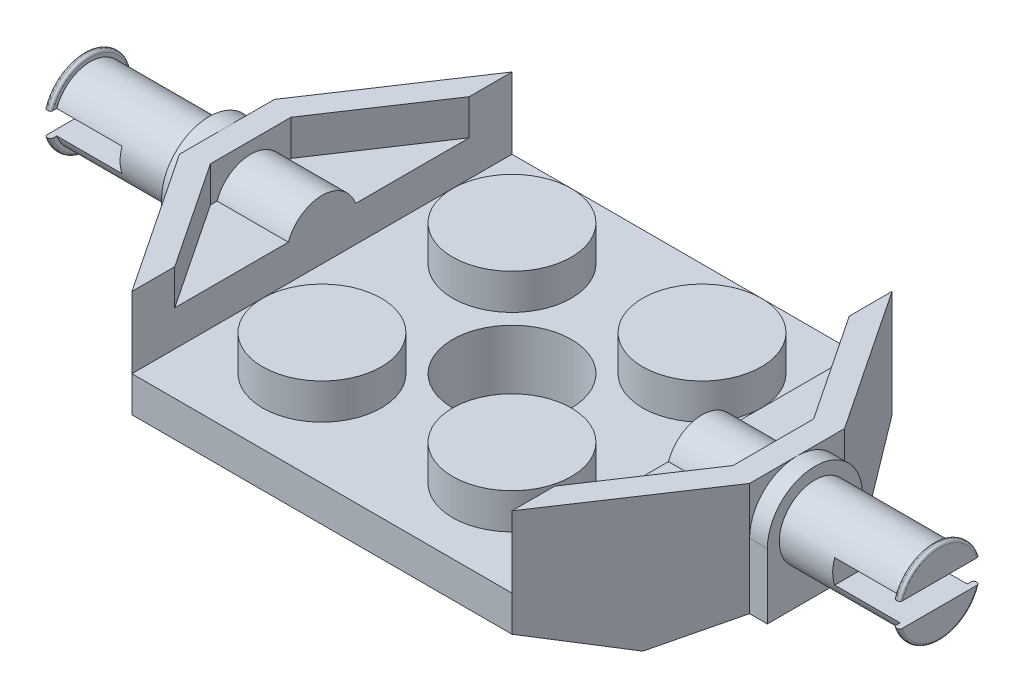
from build123d import *

# Parameters (mm, degrees)
ESQUISSE1_W                  = 16
ESQUISSE1_H                  = 16
EXTRUSION1_DEPTH             = 3
ESQUISSE2_R                  = 2.5
ENL_V_MAT_EXTRU_1_DEPTH      = 1.5
ESQUISSE3_R                  = 2.5
EXTRUSION2_DEPTH             = 1.5
ESQUISSE5_R                  = 2.5
ENL_V_MAT_EXTRU_3_DEPTH      = 1.5
EXTRUSION3_DEPTH             = 6
R_P_TITION_CIRCULAIRE1_COUNT = 2
ENL_V_MAT_EXTRU_4_DEPTH      = 1.5
R_P_TITION_CIRCULAIRE2_COUNT = 2
ENL_V_MAT_EXTRU_5_DEPTH      = 3.25
EXTRUSION4_DEPTH             = 1.75
R_P_TITION_CIRCULAIRE3_COUNT = 2
R_P_TITION_CIRCULAIRE4_COUNT = 2
ENL_V_MAT_EXTRU_6_DEPTH      = 26.475478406
ENL_V_MAT_EXTRU_7_DEPTH      = 4
R_P_TITION_CIRCULAIRE5_COUNT = 2
EXTRUSION5_DEPTH             = 0.75
ESQUISSE17_R                 = 1.5
EXTRUSION6_DEPTH             = 10
R_P_TITION_CIRCULAIRE6_COUNT = 2
R_P_TITION_CIRCULAIRE7_COUNT = 2
ESQUISSE18_R                 = 1.75
EXTRUSION7_DEPTH             = 0.25
R_P_TITION_CIRCULAIRE8_COUNT = 2
ESQUISSE19_W                 = 3
ESQUISSE19_H                 = 1
ENL_V_MAT_EXTRU_8_DEPTH      = 25.269322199
R_P_TITION_CIRCULAIRE9_COUNT = 2
CONG_1_R                     = 0.1


with BuildPart() as part:
    # Esquisse1 → Extrusion1 (new body)
    with BuildSketch(Plane(origin=(0, 0, 0), x_dir=(1, 0, 0), z_dir=(0, 1, 0))):
        Rectangle(ESQUISSE1_W, ESQUISSE1_H)
    extrude(amount=-EXTRUSION1_DEPTH)

    # Esquisse2 → Enl_v. mat.-Extru.1 (cut)
    with BuildSketch(Plane.XZ.offset(3)):
        with Locations(Location((0, 0, 0), (0, 0, 270))):
            Circle(ESQUISSE2_R)
        with BuildLine():
            Line((-7, 8), (7, 8))
            Line((7, 8), (7, 0.5))
            Line((7, 0.5), (2.831187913, 0.5))
            ThreePointArc((2.831187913, 0.5), (0, 2.875), (-2.831187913, 0.5))
            Line((-2.831187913, 0.5), (-7, 0.5))
            Line((-7, 0.5), (-7, 8))
        make_face()
        with BuildLine():
            Line((-7, -8), (7, -8))
            Line((7, -8), (7, -0.5))
            Line((7, -0.5), (2.831187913, -0.5))
            ThreePointArc((2.831187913, -0.5), (0, -2.875), (-2.831187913, -0.5))
            Line((-2.831187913, -0.5), (-7, -0.5))
            Line((-7, -0.5), (-7, -8))
        make_face()
    extrude(amount=-ENL_V_MAT_EXTRU_1_DEPTH, mode=Mode.SUBTRACT)

    # Esquisse3 → Extrusion2 (add)
    with BuildSketch(Plane(origin=(0, 0, 0), x_dir=(-1, 0, 0), z_dir=(0, 1, 0))):
        with Locations(Location((-4, -4, 0), (0, 0, 90))):
            Circle(ESQUISSE3_R)
        with Locations(Location((4, 4, 0), (0, 0, 90))):
            Circle(ESQUISSE3_R)
        with Locations(Location((-4, 4, 0), (0, 0, 90))):
            Circle(ESQUISSE3_R)
        with Locations(Location((4, -4, 0), (0, 0, 90))):
            Circle(ESQUISSE3_R)
    extrude(amount=EXTRUSION2_DEPTH)

    # Esquisse5 → Enl_v. mat.-Extru.3 (cut)
    with BuildSketch(Plane.XZ.offset(1.5)):
        with Locations(Location((0, 0, 0), (0, 0, 270))):
            Circle(ESQUISSE5_R)
    extrude(amount=-ENL_V_MAT_EXTRU_3_DEPTH, mode=Mode.SUBTRACT)

    # Esquisse7 → Extrusion3 (add)
    with BuildSketch(Plane.XZ.offset(3)):
        Polygon((-12, 2), (-12, -2), (-8, -8), (-8, 8), align=None)
    extrusion3 = extrude(amount=-EXTRUSION3_DEPTH)

    # R_p_tition circulaire1: Extrusion3 ×2 about axis
    r_p_tition_circulaire1_axis = Axis((0, 0, 0), (0, 1, 0))
    for i in range(1, R_P_TITION_CIRCULAIRE1_COUNT):
        add(extrusion3.rotate(r_p_tition_circulaire1_axis, i * 360 / R_P_TITION_CIRCULAIRE1_COUNT))

    # Esquisse8 → Enl_v. mat.-Extru.4 (cut)
    with BuildSketch(Plane(origin=(0, 3, 0), x_dir=(-1, 0, 0), z_dir=(0, 1, 0))):
        Polygon((11, -1.697224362), (8, -6.197224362), (8, 6.197224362), (11, 1.697224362), align=None)
    enl_v_mat_extru_4 = extrude(amount=-ENL_V_MAT_EXTRU_4_DEPTH, mode=Mode.SUBTRACT)

    # R_p_tition circulaire2: Enl_v. mat.-Extru.4 ×2 about axis
    r_p_tition_circulaire2_axis = Axis((0, -1.5, 0), (0, -1, 0))
    for i in range(1, R_P_TITION_CIRCULAIRE2_COUNT):
        add(enl_v_mat_extru_4.rotate(r_p_tition_circulaire2_axis, i * 360 / R_P_TITION_CIRCULAIRE2_COUNT), mode=Mode.SUBTRACT)

    # Esquisse9 → Enl_v. mat.-Extru.5 (cut)
    with BuildSketch(Plane.XZ.offset(3)):
        Polygon((-8, 6.30890027), (-8, -6.304206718), (-11, -1.804206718), (-11, 1.80890027), align=None)
    enl_v_mat_extru_5 = extrude(amount=-ENL_V_MAT_EXTRU_5_DEPTH, mode=Mode.SUBTRACT)

    # Esquisse10 → Extrusion4 (add)
    with BuildSketch(Plane.XZ.offset(-0.25)):
        Polygon((-8, 6.30890027), (-8, -6.304206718), (-9, -4.804206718), (-9, 4.80890027), align=None)
    extrusion4 = extrude(amount=EXTRUSION4_DEPTH)

    # R_p_tition circulaire3: Enl_v. mat.-Extru.5 ×2 about axis
    r_p_tition_circulaire3_axis = Axis((0, -1.5, 0), (0, -1, 0))
    for i in range(1, R_P_TITION_CIRCULAIRE3_COUNT):
        add(enl_v_mat_extru_5.rotate(r_p_tition_circulaire3_axis, i * 360 / R_P_TITION_CIRCULAIRE3_COUNT), mode=Mode.SUBTRACT)

    # R_p_tition circulaire4: Extrusion4 ×2 about axis
    r_p_tition_circulaire4_axis = Axis((0, -1.5, 0), (0, -1, 0))
    for i in range(1, R_P_TITION_CIRCULAIRE4_COUNT):
        add(extrusion4.rotate(r_p_tition_circulaire4_axis, i * 360 / R_P_TITION_CIRCULAIRE4_COUNT))

    # Esquisse12 → Enl_v. mat.-Extru.6 (cut, through all)
    with BuildSketch(Plane(origin=(12, 0, 0), x_dir=(0, 0, -1), z_dir=(1, 0, 0))):
        Polygon((-8, -1.5), (-3.75, -3), (3.75, -3), (8, -1.5), (8, -5.249846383), (-8, -5.249846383), align=None)
    extrude(amount=-ENL_V_MAT_EXTRU_6_DEPTH, mode=Mode.SUBTRACT)

    # Esquisse13 → Enl_v. mat.-Extru.7 (cut)
    with BuildSketch(Plane(origin=(12, 0, 0), x_dir=(0, 0, -1), z_dir=(1, 0, 0))):
        Polygon((4.692990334, -2.667179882), (2, -1.75), (-2, -1.75), (-4.692990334, -2.667179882), (-3.75, -3), (3.75, -3), align=None)
    enl_v_mat_extru_7 = extrude(amount=-ENL_V_MAT_EXTRU_7_DEPTH, mode=Mode.SUBTRACT)

    # R_p_tition circulaire5: Enl_v. mat.-Extru.7 ×2 about axis
    r_p_tition_circulaire5_axis = Axis((0, -1.5, 0), (0, -1, 0))
    for i in range(1, R_P_TITION_CIRCULAIRE5_COUNT):
        add(enl_v_mat_extru_7.rotate(r_p_tition_circulaire5_axis, i * 360 / R_P_TITION_CIRCULAIRE5_COUNT), mode=Mode.SUBTRACT)

    # Esquisse14 → Extrusion5 (add)
    with BuildSketch(Plane(origin=(12, 0, 0), x_dir=(0, 0, -1), z_dir=(1, 0, 0))):
        with BuildLine():
            Line((2, -1.75), (2, 1))
            ThreePointArc((2, 1), (0, 3), (-2, 1))
            Line((-2, 1), (-2, -1.75))
            Line((-2, -1.75), (2, -1.75))
        make_face()
    extrusion5 = extrude(amount=EXTRUSION5_DEPTH)

    # Esquisse17 → Extrusion6 (add)
    with BuildSketch(Plane.ZY.offset(-8)):
        with Locations((0, 1)):
            Circle(ESQUISSE17_R)
    extrusion6 = extrude(amount=-EXTRUSION6_DEPTH)

    # R_p_tition circulaire6: Extrusion5 ×2 about axis
    r_p_tition_circulaire6_axis = Axis((0, 0, 0), (0, 1, 0))
    for i in range(1, R_P_TITION_CIRCULAIRE6_COUNT):
        add(extrusion5.rotate(r_p_tition_circulaire6_axis, i * 360 / R_P_TITION_CIRCULAIRE6_COUNT))

    # R_p_tition circulaire7: Extrusion6 ×2 about axis
    r_p_tition_circulaire7_axis = Axis((0, -1.5, 0), (0, -1, 0))
    for i in range(1, R_P_TITION_CIRCULAIRE7_COUNT):
        add(extrusion6.rotate(r_p_tition_circulaire7_axis, i * 360 / R_P_TITION_CIRCULAIRE7_COUNT))

    # Esquisse18 → Extrusion7 (add)
    with BuildSketch(Plane(origin=(18, 0, 0), x_dir=(0, 0, -1), z_dir=(1, 0, 0))):
        with Locations((0, 1)):
            Circle(ESQUISSE18_R)
    extrusion7 = extrude(amount=-EXTRUSION7_DEPTH)

    # R_p_tition circulaire8: Extrusion7 ×2 about axis
    r_p_tition_circulaire8_axis = Axis((0, -1.5, 0), (0, -1, 0))
    for i in range(1, R_P_TITION_CIRCULAIRE8_COUNT):
        add(extrusion7.rotate(r_p_tition_circulaire8_axis, i * 360 / R_P_TITION_CIRCULAIRE8_COUNT))

    # Esquisse19 → Enl_v. mat.-Extru.8 (cut, through all)
    with BuildSketch(Plane(origin=(0, 0, -8), x_dir=(-1, 0, 0), z_dir=(0, 0, -1))):
        with Locations((-16.5, 1)):
            Rectangle(ESQUISSE19_W, ESQUISSE19_H)
    enl_v_mat_extru_8 = extrude(amount=-ENL_V_MAT_EXTRU_8_DEPTH, mode=Mode.SUBTRACT)

    # R_p_tition circulaire9: Enl_v. mat.-Extru.8 ×2 about axis
    r_p_tition_circulaire9_axis = Axis((0, -1.5, 0), (0, -1, 0))
    for i in range(1, R_P_TITION_CIRCULAIRE9_COUNT):
        add(enl_v_mat_extru_8.rotate(r_p_tition_circulaire9_axis, i * 360 / R_P_TITION_CIRCULAIRE9_COUNT), mode=Mode.SUBTRACT)

    # Cong_1
    cong_1_edges = [part.edges().sort_by_distance(p)[0] for p in [
        (17.75, 2.75, 0),
        (18, 2.75, 0),
        (-17.75, 2.75, 0),
        (-18, 2.75, 0),
        (18, -0.75, 0),
        (17.75, -0.75, 0),
        (-18, -0.75, 0),
        (-17.75, -0.75, 0),
    ]]
    fillet(cong_1_edges, radius=CONG_1_R)


solid = part.part
